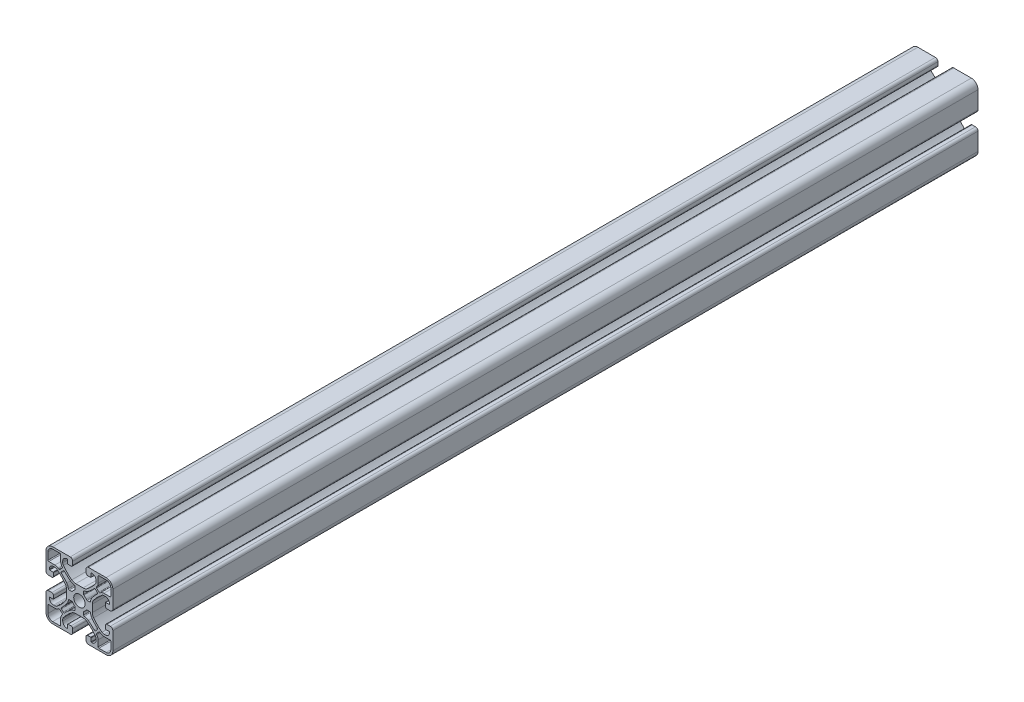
from build123d import *

# Parameters (mm, degrees)
ESQUISSE_PROFIL_R = 3.400000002
EXTRUSION1_DEPTH  = 518


with BuildPart() as part:
    # Esquisse profil → Extrusion1 (new body)
    with BuildSketch(Plane.XY):
        with BuildLine():
            Line((5.500000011, -20), (15.999999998, -20))
            ThreePointArc((15.999999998, -20), (18.82842711, -18.82842713), (20, -16.000000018))
            Line((20, -16.000000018), (20, -5.500000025))
            ThreePointArc((20, -5.500000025), (19.560660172, -4.439339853), (18.5, -4.000000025))
            Line((18.5, -4.000000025), (16.5, -4.000000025))
            ThreePointArc((16.5, -4.000000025), (15.792893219, -4.292893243), (15.5, -5.000000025))
            Line((15.5, -5.000000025), (15.5, -6.750000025))
            ThreePointArc((15.5, -6.750000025), (15.573223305, -6.92677672), (15.75, -7.000000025))
            Line((15.75, -7.000000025), (17.75, -7.000000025))
            ThreePointArc((17.75, -7.000000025), (17.926776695, -7.073223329), (18, -7.250000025))
            Line((18, -7.250000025), (18, -7.500000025))
            ThreePointArc((18, -7.500000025), (17.267766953, -9.267766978), (15.5, -10.000000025))
            Line((15.5, -10.000000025), (14.72036024, -10.000000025))
            ThreePointArc((14.72036024, -10.000000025), (14.083793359, -9.895991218), (13.51343504, -9.594782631))
            ThreePointArc((13.51343504, -9.594782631), (10.848996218, -7.2640298), (8.540476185, -4.580305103))
            ThreePointArc((8.540476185, -4.580305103), (7.952757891, -3.450415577), (7.75, -2.193056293))
            Line((7.75, -2.193056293), (7.75, 2.193056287))
            ThreePointArc((7.75, 2.193056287), (7.952757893, 3.450415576), (8.54047619, 4.580305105))
            ThreePointArc((8.54047619, 4.580305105), (10.848996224, 7.264029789), (13.513435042, 9.594782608))
            ThreePointArc((13.513435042, 9.594782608), (14.083793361, 9.895991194), (14.72036024, 10))
            Line((14.72036024, 10), (15.5, 10))
            ThreePointArc((15.5, 10), (17.267766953, 9.267766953), (18, 7.5))
            Line((18, 7.5), (18, 7.25))
            ThreePointArc((18, 7.25), (17.926776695, 7.073223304), (17.75, 7))
            Line((17.75, 7), (15.75, 7))
            ThreePointArc((15.75, 7), (15.573223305, 6.926776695), (15.5, 6.75))
            Line((15.5, 6.75), (15.5, 5))
            ThreePointArc((15.5, 5), (15.792893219, 4.292893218), (16.5, 4))
            Line((16.5, 4), (18.5, 4))
            ThreePointArc((18.5, 4), (19.560660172, 4.439339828), (20, 5.5))
            Line((20, 5.5), (20, 16.000000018))
            ThreePointArc((20, 16.000000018), (18.828427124, 18.828427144), (15.999999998, 20))
            Line((15.999999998, 20), (5.500000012, 20))
            ThreePointArc((5.500000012, 20), (4.43933984, 19.560660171), (4.000000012, 18.5))
            Line((4.000000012, 18.5), (4.000000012, 16.5))
            ThreePointArc((4.000000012, 16.5), (4.292893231, 15.792893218), (5.000000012, 15.5))
            Line((5.000000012, 15.5), (6.750000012, 15.5))
            ThreePointArc((6.750000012, 15.5), (6.926776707, 15.573223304), (7.000000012, 15.75))
            Line((7.000000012, 15.75), (7.000000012, 17.75))
            ThreePointArc((7.000000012, 17.75), (7.073223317, 17.926776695), (7.250000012, 18))
            Line((7.250000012, 18), (7.500000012, 18))
            ThreePointArc((7.500000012, 18), (9.267766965, 17.267766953), (10.000000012, 15.5))
            Line((10.000000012, 15.5), (10.000000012, 14.72036024))
            ThreePointArc((10.000000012, 14.72036024), (9.895991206, 14.083793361), (9.594782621, 13.513435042))
            ThreePointArc((9.594782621, 13.513435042), (7.264029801, 10.848996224), (4.580305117, 8.540476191))
            ThreePointArc((4.580305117, 8.540476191), (3.450415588, 7.952757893), (2.193056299, 7.75))
            Line((2.193056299, 7.75), (-2.193056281, 7.75))
            ThreePointArc((-2.193056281, 7.75), (-3.45041557, 7.952757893), (-4.580305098, 8.54047619))
            ThreePointArc((-4.580305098, 8.54047619), (-7.264029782, 10.848996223), (-9.594782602, 13.513435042))
            ThreePointArc((-9.594782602, 13.513435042), (-9.895991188, 14.08379336), (-9.999999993, 14.72036024))
            Line((-9.999999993, 14.72036024), (-9.999999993, 15.5))
            ThreePointArc((-9.999999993, 15.5), (-9.267766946, 17.267766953), (-7.499999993, 18))
            Line((-7.499999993, 18), (-7.249999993, 18))
            ThreePointArc((-7.249999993, 18), (-7.073223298, 17.926776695), (-6.999999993, 17.75))
            Line((-6.999999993, 17.75), (-6.999999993, 15.75))
            ThreePointArc((-6.999999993, 15.75), (-6.926776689, 15.573223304), (-6.749999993, 15.5))
            Line((-6.749999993, 15.5), (-4.999999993, 15.5))
            ThreePointArc((-4.999999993, 15.5), (-4.292893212, 15.792893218), (-3.999999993, 16.5))
            Line((-3.999999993, 16.5), (-3.999999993, 18.5))
            ThreePointArc((-3.999999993, 18.5), (-4.439339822, 19.560660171), (-5.499999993, 20))
            Line((-5.499999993, 20), (-15.999999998, 20))
            ThreePointArc((-15.999999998, 20), (-18.82842711, 18.82842713), (-20, 16.000000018))
            Line((-20, 16.000000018), (-20, 5.499999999))
            ThreePointArc((-20, 5.499999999), (-19.560660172, 4.439339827), (-18.5, 3.999999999))
            Line((-18.5, 3.999999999), (-16.5, 3.999999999))
            ThreePointArc((-16.5, 3.999999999), (-15.792893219, 4.292893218), (-15.5, 4.999999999))
            Line((-15.5, 4.999999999), (-15.5, 6.749999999))
            ThreePointArc((-15.5, 6.749999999), (-15.573223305, 6.926776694), (-15.75, 6.999999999))
            Line((-15.75, 6.999999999), (-17.75, 6.999999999))
            ThreePointArc((-17.75, 6.999999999), (-17.926776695, 7.073223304), (-18, 7.249999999))
            Line((-18, 7.249999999), (-18, 7.499999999))
            ThreePointArc((-18, 7.499999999), (-17.267766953, 9.267766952), (-15.5, 9.999999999))
            Line((-15.5, 9.999999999), (-14.72036024, 9.999999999))
            ThreePointArc((-14.72036024, 9.999999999), (-14.083793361, 9.895991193), (-13.513435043, 9.594782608))
            ThreePointArc((-13.513435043, 9.594782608), (-10.848996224, 7.264029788), (-8.540476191, 4.580305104))
            ThreePointArc((-8.540476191, 4.580305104), (-7.952757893, 3.450415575), (-7.75, 2.193056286))
            Line((-7.75, 2.193056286), (-7.75, -2.193056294))
            ThreePointArc((-7.75, -2.193056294), (-7.952757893, -3.450415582), (-8.54047619, -4.580305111))
            ThreePointArc((-8.54047619, -4.580305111), (-10.848996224, -7.264029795), (-13.513435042, -9.594782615))
            ThreePointArc((-13.513435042, -9.594782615), (-14.083793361, -9.8959912), (-14.72036024, -10.000000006))
            Line((-14.72036024, -10.000000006), (-15.5, -10.000000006))
            ThreePointArc((-15.5, -10.000000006), (-17.267766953, -9.267766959), (-18, -7.500000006))
            Line((-18, -7.500000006), (-18, -7.250000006))
            ThreePointArc((-18, -7.250000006), (-17.926776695, -7.073223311), (-17.75, -7.000000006))
            Line((-17.75, -7.000000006), (-15.75, -7.000000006))
            ThreePointArc((-15.75, -7.000000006), (-15.573223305, -6.926776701), (-15.5, -6.750000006))
            Line((-15.5, -6.750000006), (-15.5, -5.000000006))
            ThreePointArc((-15.5, -5.000000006), (-15.792893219, -4.292893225), (-16.5, -4.000000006))
            Line((-16.5, -4.000000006), (-18.5, -4.000000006))
            ThreePointArc((-18.5, -4.000000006), (-19.560660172, -4.439339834), (-20, -5.500000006))
            Line((-20, -5.500000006), (-20, -15.999999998))
            ThreePointArc((-20, -15.999999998), (-18.828427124, -18.828427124), (-15.999999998, -20))
            Line((-15.999999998, -20), (-5.499999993, -20))
            ThreePointArc((-5.499999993, -20), (-4.439339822, -19.560660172), (-3.999999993, -18.5))
            Line((-3.999999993, -18.5), (-3.999999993, -16.5))
            ThreePointArc((-3.999999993, -16.5), (-4.292893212, -15.792893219), (-4.999999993, -15.5))
            Line((-4.999999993, -15.5), (-6.749999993, -15.5))
            ThreePointArc((-6.749999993, -15.5), (-6.926776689, -15.573223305), (-6.999999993, -15.75))
            Line((-6.999999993, -15.75), (-6.999999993, -17.75))
            ThreePointArc((-6.999999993, -17.75), (-7.073223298, -17.926776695), (-7.249999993, -18))
            Line((-7.249999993, -18), (-7.499999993, -18))
            ThreePointArc((-7.499999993, -18), (-9.267766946, -17.267766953), (-9.999999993, -15.5))
            Line((-9.999999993, -15.5), (-9.999999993, -14.72036024))
            ThreePointArc((-9.999999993, -14.72036024), (-9.895991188, -14.083793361), (-9.594782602, -13.513435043))
            ThreePointArc((-9.594782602, -13.513435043), (-7.264029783, -10.848996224), (-4.580305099, -8.540476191))
            ThreePointArc((-4.580305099, -8.540476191), (-3.45041557, -7.952757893), (-2.193056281, -7.75))
            Line((-2.193056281, -7.75), (2.193056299, -7.75))
            ThreePointArc((2.193056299, -7.75), (3.450415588, -7.952757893), (4.580305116, -8.54047619))
            ThreePointArc((4.580305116, -8.54047619), (7.264029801, -10.848996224), (9.59478262, -13.513435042))
            ThreePointArc((9.59478262, -13.513435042), (9.895991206, -14.083793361), (10.000000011, -14.72036024))
            Line((10.000000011, -14.72036024), (10.000000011, -15.5))
            ThreePointArc((10.000000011, -15.5), (9.267766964, -17.267766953), (7.500000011, -18))
            Line((7.500000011, -18), (7.250000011, -18))
            ThreePointArc((7.250000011, -18), (7.073223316, -17.926776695), (7.000000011, -17.75))
            Line((7.000000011, -17.75), (7.000000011, -15.75))
            ThreePointArc((7.000000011, -15.75), (6.926776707, -15.573223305), (6.750000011, -15.5))
            Line((6.750000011, -15.5), (5.000000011, -15.5))
            ThreePointArc((5.000000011, -15.5), (4.29289323, -15.792893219), (4.000000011, -16.5))
            Line((4.000000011, -16.5), (4.000000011, -18.5))
            ThreePointArc((4.000000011, -18.5), (4.43933984, -19.560660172), (5.500000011, -20))
        make_face()
        Circle(ESQUISSE_PROFIL_R, mode=Mode.SUBTRACT)
        with BuildLine():
            Line((11.699666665, 18.8), (15.999999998, 18.8))
            ThreePointArc((15.999999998, 18.8), (17.979898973, 17.979898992), (18.8, 16.000000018))
            Line((18.8, 16.000000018), (18.8, 11.699999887))
            ThreePointArc((18.8, 11.699999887), (18.653553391, 11.346446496), (18.3, 11.199999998))
            Line((18.3, 11.199999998), (14.670026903, 11.199999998))
            ThreePointArc((14.670026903, 11.199999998), (13.651519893, 11.033585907), (12.738946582, 10.551652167))
            Line((12.738946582, 10.551652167), (12.395722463, 10.287411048))
            ThreePointArc((12.395722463, 10.287411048), (12.057202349, 10.181979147), (11.733887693, 10.327510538))
            Line((11.733887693, 10.327510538), (10.327177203, 11.734221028))
            ThreePointArc((10.327177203, 11.734221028), (10.181645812, 12.057535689), (10.287077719, 12.396055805))
            Line((10.287077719, 12.396055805), (10.551318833, 12.739279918))
            ThreePointArc((10.551318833, 12.739279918), (11.033252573, 13.651853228), (11.199666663, 14.670360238))
            Line((11.199666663, 14.670360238), (11.199666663, 18.299999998))
            ThreePointArc((11.199666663, 18.299999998), (11.346113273, 18.65355339), (11.699666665, 18.8))
        make_face(mode=Mode.SUBTRACT)
        with BuildLine():
            Line((-11.199666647, 14.669919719), (-11.199666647, 18.299999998))
            ThreePointArc((-11.199666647, 18.299999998), (-11.346113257, 18.65355339), (-11.699666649, 18.8))
            Line((-11.699666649, 18.8), (-15.999999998, 18.8))
            ThreePointArc((-15.999999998, 18.8), (-17.979898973, 17.979898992), (-18.8, 16.000000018))
            Line((-18.8, 16.000000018), (-18.8, 11.699999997))
            ThreePointArc((-18.8, 11.699999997), (-18.653553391, 11.346446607), (-18.3, 11.199999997))
            Line((-18.3, 11.199999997), (-14.67036024, 11.199999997))
            ThreePointArc((-14.67036024, 11.199999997), (-13.65185323, 11.033585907), (-12.739279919, 10.551652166))
            Line((-12.739279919, 10.551652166), (-12.3960558, 10.287411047))
            ThreePointArc((-12.3960558, 10.287411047), (-12.057535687, 10.181979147), (-11.73422103, 10.327510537))
            Line((-11.73422103, 10.327510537), (-10.32751054, 11.734221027))
            ThreePointArc((-10.32751054, 11.734221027), (-10.181979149, 12.057535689), (-10.287411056, 12.396055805))
            Line((-10.287411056, 12.396055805), (-10.551651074, 12.739278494))
            ThreePointArc((-10.551651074, 12.739278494), (-11.033340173, 13.651673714), (-11.199666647, 14.669919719))
        make_face(mode=Mode.SUBTRACT)
        with BuildLine():
            Line((-2.500000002, 6.098239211), (-2.500000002, 4.609772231))
            ThreePointArc((-2.500000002, 4.609772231), (-2.560475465, 4.371406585), (-2.727272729, 4.19070203))
            ThreePointArc((-2.727272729, 4.19070203), (-3.535533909, 3.535533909), (-4.19070203, 2.727272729))
            ThreePointArc((-4.19070203, 2.727272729), (-4.371406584, 2.560475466), (-4.609772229, 2.500000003))
            Line((-4.609772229, 2.500000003), (-6.098239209, 2.500000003))
            ThreePointArc((-6.098239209, 2.500000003), (-6.428045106, 2.62419677), (-6.594007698, 2.935087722))
            ThreePointArc((-6.594007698, 2.935087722), (-6.934262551, 4.221803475), (-7.589999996, 5.380000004))
            ThreePointArc((-7.589999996, 5.380000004), (-9.089852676, 7.202595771), (-10.747651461, 8.882809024))
            ThreePointArc((-10.747651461, 8.882809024), (-10.907820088, 9.24007063), (-10.761465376, 9.603209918))
            Line((-10.761465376, 9.603209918), (-9.603209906, 10.761465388))
            ThreePointArc((-9.603209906, 10.761465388), (-9.240070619, 10.907820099), (-8.882809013, 10.747651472))
            ThreePointArc((-8.882809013, 10.747651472), (-7.202595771, 9.089852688), (-5.380000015, 7.590000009))
            ThreePointArc((-5.380000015, 7.590000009), (-4.221803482, 6.934262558), (-2.935087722, 6.594007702))
            ThreePointArc((-2.935087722, 6.594007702), (-2.624196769, 6.428045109), (-2.500000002, 6.098239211))
        make_face(mode=Mode.SUBTRACT)
        with BuildLine():
            Line((-10.761465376, -9.603209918), (-9.603209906, -10.761465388))
            ThreePointArc((-9.603209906, -10.761465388), (-9.240070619, -10.907820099), (-8.882809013, -10.747651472))
            ThreePointArc((-8.882809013, -10.747651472), (-7.202595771, -9.089852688), (-5.380000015, -7.590000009))
            ThreePointArc((-5.380000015, -7.590000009), (-4.221803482, -6.934262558), (-2.935087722, -6.594007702))
            ThreePointArc((-2.935087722, -6.594007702), (-2.624196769, -6.428045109), (-2.500000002, -6.098239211))
            Line((-2.500000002, -6.098239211), (-2.500000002, -4.609772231))
            ThreePointArc((-2.500000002, -4.609772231), (-2.560475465, -4.371406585), (-2.727272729, -4.19070203))
            ThreePointArc((-2.727272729, -4.19070203), (-3.535533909, -3.535533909), (-4.19070203, -2.727272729))
            ThreePointArc((-4.19070203, -2.727272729), (-4.371406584, -2.560475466), (-4.609772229, -2.500000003))
            Line((-4.609772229, -2.500000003), (-6.098239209, -2.500000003))
            ThreePointArc((-6.098239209, -2.500000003), (-6.428045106, -2.62419677), (-6.594007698, -2.935087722))
            ThreePointArc((-6.594007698, -2.935087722), (-6.934262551, -4.221803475), (-7.589999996, -5.380000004))
            ThreePointArc((-7.589999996, -5.380000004), (-9.089852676, -7.202595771), (-10.747651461, -8.882809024))
            ThreePointArc((-10.747651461, -8.882809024), (-10.907820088, -9.24007063), (-10.761465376, -9.603209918))
        make_face(mode=Mode.SUBTRACT)
        with BuildLine():
            Line((-11.699999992, -18.8), (-15.999999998, -18.8))
            ThreePointArc((-15.999999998, -18.8), (-17.979898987, -17.979898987), (-18.8, -15.999999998))
            Line((-18.8, -15.999999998), (-18.8, -11.700000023))
            ThreePointArc((-18.8, -11.700000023), (-18.653553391, -11.346446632), (-18.3, -11.200000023))
            Line((-18.3, -11.200000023), (-14.67036024, -11.200000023))
            ThreePointArc((-14.67036024, -11.200000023), (-13.65185323, -11.033585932), (-12.739279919, -10.551652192))
            Line((-12.739279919, -10.551652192), (-12.3960558, -10.287411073))
            ThreePointArc((-12.3960558, -10.287411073), (-12.057535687, -10.181979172), (-11.73422103, -10.327510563))
            Line((-11.73422103, -10.327510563), (-10.32751054, -11.734221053))
            ThreePointArc((-10.32751054, -11.734221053), (-10.181979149, -12.057535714), (-10.287411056, -12.39605583))
            Line((-10.287411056, -12.39605583), (-10.55165217, -12.739279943))
            ThreePointArc((-10.55165217, -12.739279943), (-11.033585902, -13.651853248), (-11.19999999, -14.670360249))
            Line((-11.19999999, -14.670360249), (-11.19999999, -18.299999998))
            ThreePointArc((-11.19999999, -18.299999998), (-11.3464466, -18.65355339), (-11.699999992, -18.8))
        make_face(mode=Mode.SUBTRACT)
        with BuildLine():
            Line((9.603209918, 10.761465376), (10.761465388, 9.603209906))
            ThreePointArc((10.761465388, 9.603209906), (10.907820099, 9.240070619), (10.747651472, 8.882809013))
            ThreePointArc((10.747651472, 8.882809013), (9.089852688, 7.202595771), (7.590000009, 5.380000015))
            ThreePointArc((7.590000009, 5.380000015), (6.934262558, 4.221803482), (6.594007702, 2.935087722))
            ThreePointArc((6.594007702, 2.935087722), (6.428045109, 2.624196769), (6.098239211, 2.500000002))
            Line((6.098239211, 2.500000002), (4.609772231, 2.500000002))
            ThreePointArc((4.609772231, 2.500000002), (4.371406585, 2.560475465), (4.19070203, 2.727272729))
            ThreePointArc((4.19070203, 2.727272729), (3.535533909, 3.535533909), (2.727272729, 4.19070203))
            ThreePointArc((2.727272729, 4.19070203), (2.560475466, 4.371406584), (2.500000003, 4.609772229))
            Line((2.500000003, 4.609772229), (2.500000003, 6.098239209))
            ThreePointArc((2.500000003, 6.098239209), (2.62419677, 6.428045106), (2.935087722, 6.594007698))
            ThreePointArc((2.935087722, 6.594007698), (4.221803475, 6.934262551), (5.380000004, 7.589999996))
            ThreePointArc((5.380000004, 7.589999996), (7.202595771, 9.089852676), (8.882809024, 10.747651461))
            ThreePointArc((8.882809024, 10.747651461), (9.24007063, 10.907820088), (9.603209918, 10.761465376))
        make_face(mode=Mode.SUBTRACT)
        with BuildLine():
            Line((2.500000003, -4.609772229), (2.500000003, -6.098239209))
            ThreePointArc((2.500000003, -6.098239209), (2.62419677, -6.428045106), (2.935087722, -6.594007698))
            ThreePointArc((2.935087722, -6.594007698), (4.221803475, -6.934262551), (5.380000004, -7.589999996))
            ThreePointArc((5.380000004, -7.589999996), (7.202595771, -9.089852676), (8.882809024, -10.747651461))
            ThreePointArc((8.882809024, -10.747651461), (9.24007063, -10.907820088), (9.603209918, -10.761465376))
            Line((9.603209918, -10.761465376), (10.761465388, -9.603209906))
            ThreePointArc((10.761465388, -9.603209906), (10.907820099, -9.240070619), (10.747651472, -8.882809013))
            ThreePointArc((10.747651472, -8.882809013), (9.089852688, -7.202595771), (7.590000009, -5.380000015))
            ThreePointArc((7.590000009, -5.380000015), (6.934262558, -4.221803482), (6.594007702, -2.935087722))
            ThreePointArc((6.594007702, -2.935087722), (6.428045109, -2.624196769), (6.098239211, -2.500000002))
            Line((6.098239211, -2.500000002), (4.609772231, -2.500000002))
            ThreePointArc((4.609772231, -2.500000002), (4.371406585, -2.560475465), (4.19070203, -2.727272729))
            ThreePointArc((4.19070203, -2.727272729), (3.535533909, -3.535533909), (2.727272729, -4.19070203))
            ThreePointArc((2.727272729, -4.19070203), (2.560475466, -4.371406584), (2.500000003, -4.609772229))
        make_face(mode=Mode.SUBTRACT)
        with BuildLine():
            Line((11.199666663, -14.670360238), (11.199666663, -18.299999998))
            ThreePointArc((11.199666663, -18.299999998), (11.346113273, -18.65355339), (11.699666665, -18.8))
            Line((11.699666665, -18.8), (15.999999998, -18.8))
            ThreePointArc((15.999999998, -18.8), (17.979898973, -17.979898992), (18.8, -16.000000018))
            Line((18.8, -16.000000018), (18.8, -11.699999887))
            ThreePointArc((18.8, -11.699999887), (18.653553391, -11.346446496), (18.3, -11.199999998))
            Line((18.3, -11.199999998), (14.670026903, -11.199999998))
            ThreePointArc((14.670026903, -11.199999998), (13.651519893, -11.033585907), (12.738946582, -10.551652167))
            Line((12.738946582, -10.551652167), (12.395722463, -10.287411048))
            ThreePointArc((12.395722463, -10.287411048), (12.057202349, -10.181979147), (11.733887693, -10.327510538))
            Line((11.733887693, -10.327510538), (10.327177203, -11.734221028))
            ThreePointArc((10.327177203, -11.734221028), (10.181645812, -12.057535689), (10.287077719, -12.396055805))
            Line((10.287077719, -12.396055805), (10.551318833, -12.739279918))
            ThreePointArc((10.551318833, -12.739279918), (11.033252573, -13.651853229), (11.199666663, -14.670360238))
        make_face(mode=Mode.SUBTRACT)
    extrude(amount=EXTRUSION1_DEPTH)


solid = part.part
